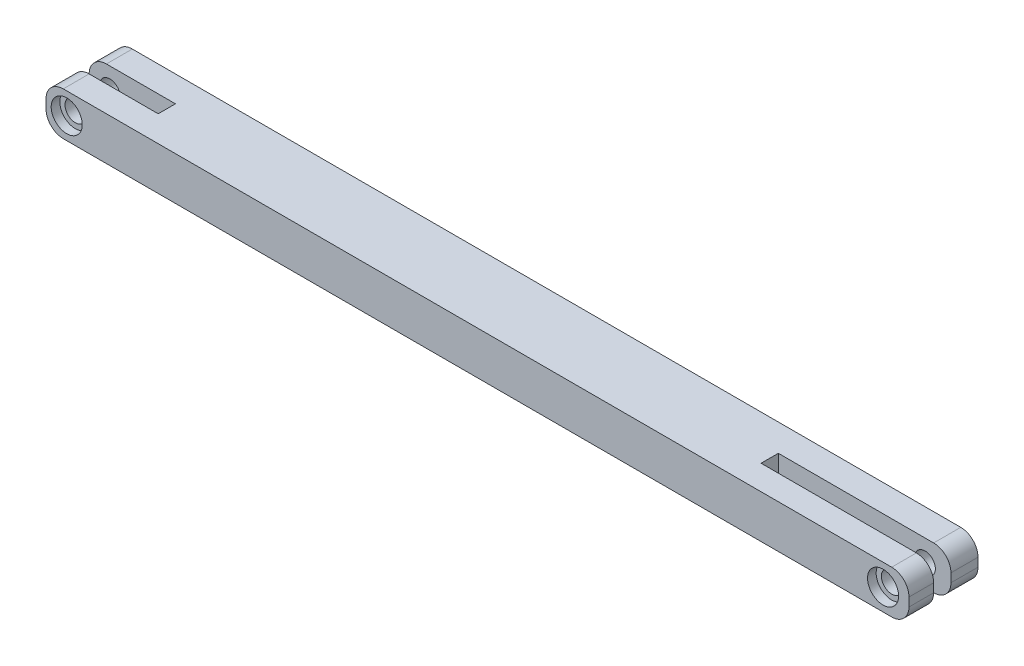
ISO-10303-21;
HEADER;
FILE_DESCRIPTION(('STEP AP214'),'2;1');
FILE_NAME('part.step','',(''),(''),'','','');
FILE_SCHEMA(('AUTOMOTIVE_DESIGN { 1 0 10303 214 1 1 1 1 }'));
ENDSEC;
DATA;
#1=APPLICATION_CONTEXT('core data for automotive mechanical design processes');
#2=APPLICATION_PROTOCOL_DEFINITION('international standard','automotive_design',2000,#1);
#3=PRODUCT_CONTEXT('',#1,'mechanical');
#4=PRODUCT('Part','Part','',(#3));
#5=PRODUCT_RELATED_PRODUCT_CATEGORY('part','',(#4));
#6=PRODUCT_DEFINITION_FORMATION('','',#4);
#7=PRODUCT_DEFINITION_CONTEXT('part definition',#1,'design');
#8=PRODUCT_DEFINITION('design','',#6,#7);
#9=PRODUCT_DEFINITION_SHAPE('','',#8);
#10=(LENGTH_UNIT() NAMED_UNIT(*) SI_UNIT(.MILLI.,.METRE.));
#11=(NAMED_UNIT(*) PLANE_ANGLE_UNIT() SI_UNIT($,.RADIAN.));
#12=(NAMED_UNIT(*) SI_UNIT($,.STERADIAN.) SOLID_ANGLE_UNIT());
#13=UNCERTAINTY_MEASURE_WITH_UNIT(LENGTH_MEASURE(1.E-05),#10,'distance_accuracy_value','');
#14=(GEOMETRIC_REPRESENTATION_CONTEXT(3) GLOBAL_UNCERTAINTY_ASSIGNED_CONTEXT((#13)) GLOBAL_UNIT_ASSIGNED_CONTEXT((#10,
#11,#12)) REPRESENTATION_CONTEXT('',''));
#15=CARTESIAN_POINT('',(0.,0.,0.));
#16=DIRECTION('',(0.,0.,1.));
#17=DIRECTION('',(1.,0.,0.));
#18=AXIS2_PLACEMENT_3D('',#15,#16,#17);
#19=CARTESIAN_POINT('',(485.,12.5,40.));
#20=DIRECTION('',(0.,0.,-1.));
#21=DIRECTION('',(-1.,0.,0.));
#22=AXIS2_PLACEMENT_3D('',#19,#20,#21);
#23=CYLINDRICAL_SURFACE('',#22,5.99999999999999);
#24=CARTESIAN_POINT('',(485.,12.5,15.6934513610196));
#25=DIRECTION('',(0.,0.,-1.));
#26=DIRECTION('',(0.,1.,0.));
#27=AXIS2_PLACEMENT_3D('',#24,#25,#26);
#28=CIRCLE('',#27,5.99999999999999);
#29=CARTESIAN_POINT('',(485.,18.5,15.6934513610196));
#30=VERTEX_POINT('',#29);
#31=EDGE_CURVE('E211',#30,#30,#28,.T.);
#32=ORIENTED_EDGE('',*,*,#31,.F.);
#33=EDGE_LOOP('',(#32));
#34=FACE_BOUND('',#33,.T.);
#35=CARTESIAN_POINT('',(485.,12.5,5.));
#36=DIRECTION('',(0.,0.,-1.));
#37=DIRECTION('',(-1.,0.,0.));
#38=AXIS2_PLACEMENT_3D('',#35,#36,#37);
#39=CIRCLE('',#38,5.99999999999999);
#40=CARTESIAN_POINT('',(479.,12.5,5.));
#41=VERTEX_POINT('',#40);
#42=EDGE_CURVE('E42',#41,#41,#39,.T.);
#43=ORIENTED_EDGE('',*,*,#42,.T.);
#44=EDGE_LOOP('',(#43));
#45=FACE_BOUND('',#44,.T.);
#46=ADVANCED_FACE('F38',(#34,#45),#23,.F.);
#47=CARTESIAN_POINT('',(485.,12.5,25.6934513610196));
#48=DIRECTION('',(0.,0.,1.));
#49=DIRECTION('',(1.,0.,0.));
#50=AXIS2_PLACEMENT_3D('',#47,#48,#49);
#51=CIRCLE('',#50,5.99999999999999);
#52=CARTESIAN_POINT('',(491.,12.5,25.6934513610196));
#53=VERTEX_POINT('',#52);
#54=EDGE_CURVE('E222',#53,#53,#51,.T.);
#55=ORIENTED_EDGE('',*,*,#54,.F.);
#56=EDGE_LOOP('',(#55));
#57=FACE_BOUND('',#56,.T.);
#58=CARTESIAN_POINT('',(485.,12.5,35.));
#59=DIRECTION('',(0.,0.,1.));
#60=DIRECTION('',(1.,0.,0.));
#61=AXIS2_PLACEMENT_3D('',#58,#59,#60);
#62=CIRCLE('',#61,5.99999999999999);
#63=CARTESIAN_POINT('',(491.,12.5,35.));
#64=VERTEX_POINT('',#63);
#65=EDGE_CURVE('E332',#64,#64,#62,.T.);
#66=ORIENTED_EDGE('',*,*,#65,.T.);
#67=EDGE_LOOP('',(#66));
#68=FACE_BOUND('',#67,.T.);
#69=ADVANCED_FACE('F445',(#57,#68),#23,.F.);
#70=CARTESIAN_POINT('',(490.,10.,40.));
#71=DIRECTION('',(0.,0.,-1.));
#72=DIRECTION('',(-1.,0.,0.));
#73=AXIS2_PLACEMENT_3D('',#70,#71,#72);
#74=CYLINDRICAL_SURFACE('',#73,10.);
#75=DIRECTION('',(0.,0.,-1.));
#76=VECTOR('',#75,1.);
#77=CARTESIAN_POINT('',(490.,0.,40.));
#78=LINE('',#77,#76);
#79=CARTESIAN_POINT('',(490.,0.,40.));
#80=VERTEX_POINT('',#79);
#81=CARTESIAN_POINT('',(490.,0.,25.6934513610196));
#82=VERTEX_POINT('',#81);
#83=EDGE_CURVE('E319',#80,#82,#78,.T.);
#84=ORIENTED_EDGE('',*,*,#83,.T.);
#85=CARTESIAN_POINT('',(490.,10.,25.6934513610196));
#86=DIRECTION('',(0.,0.,1.));
#87=DIRECTION('',(1.,0.,0.));
#88=AXIS2_PLACEMENT_3D('',#85,#86,#87);
#89=CIRCLE('',#88,10.);
#90=CARTESIAN_POINT('',(500.,10.0000000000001,25.6934513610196));
#91=VERTEX_POINT('',#90);
#92=EDGE_CURVE('E183',#82,#91,#89,.T.);
#93=ORIENTED_EDGE('',*,*,#92,.T.);
#94=DIRECTION('',(0.,0.,-1.));
#95=VECTOR('',#94,1.);
#96=CARTESIAN_POINT('',(500.,10.0000000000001,40.));
#97=LINE('',#96,#95);
#98=CARTESIAN_POINT('',(500.,10.0000000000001,40.));
#99=VERTEX_POINT('',#98);
#100=EDGE_CURVE('E315',#99,#91,#97,.T.);
#101=ORIENTED_EDGE('',*,*,#100,.F.);
#102=CARTESIAN_POINT('',(490.,10.,40.));
#103=DIRECTION('',(0.,0.,1.));
#104=DIRECTION('',(-1.,0.,0.));
#105=AXIS2_PLACEMENT_3D('',#102,#103,#104);
#106=CIRCLE('',#105,10.);
#107=EDGE_CURVE('E272',#80,#99,#106,.T.);
#108=ORIENTED_EDGE('',*,*,#107,.F.);
#109=EDGE_LOOP('',(#84,#93,#101,#108));
#110=FACE_BOUND('',#109,.T.);
#111=ADVANCED_FACE('F385',(#110),#74,.T.);
#112=CARTESIAN_POINT('',(500.,10.0000000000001,40.));
#113=DIRECTION('',(-1.,0.,0.));
#114=DIRECTION('',(0.,0.,1.));
#115=AXIS2_PLACEMENT_3D('',#112,#113,#114);
#116=PLANE('',#115);
#117=ORIENTED_EDGE('',*,*,#100,.T.);
#118=DIRECTION('',(0.,-1.,0.));
#119=VECTOR('',#118,1.);
#120=CARTESIAN_POINT('',(500.,25.,25.6934513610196));
#121=LINE('',#120,#119);
#122=CARTESIAN_POINT('',(500.,15.,25.6934513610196));
#123=VERTEX_POINT('',#122);
#124=EDGE_CURVE('E205',#123,#91,#121,.T.);
#125=ORIENTED_EDGE('',*,*,#124,.F.);
#126=DIRECTION('',(0.,0.,-1.));
#127=VECTOR('',#126,1.);
#128=CARTESIAN_POINT('',(500.,14.9999999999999,40.));
#129=LINE('',#128,#127);
#130=CARTESIAN_POINT('',(500.,14.9999999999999,40.));
#131=VERTEX_POINT('',#130);
#132=EDGE_CURVE('E311',#131,#123,#129,.T.);
#133=ORIENTED_EDGE('',*,*,#132,.F.);
#134=DIRECTION('',(0.,1.,0.));
#135=VECTOR('',#134,1.);
#136=CARTESIAN_POINT('',(500.,10.0000000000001,40.));
#137=LINE('',#136,#135);
#138=EDGE_CURVE('E274',#99,#131,#137,.T.);
#139=ORIENTED_EDGE('',*,*,#138,.F.);
#140=EDGE_LOOP('',(#117,#125,#133,#139));
#141=FACE_BOUND('',#140,.T.);
#142=ADVANCED_FACE('F390',(#141),#116,.F.);
#143=CARTESIAN_POINT('',(490.,15.,40.));
#144=DIRECTION('',(0.,0.,-1.));
#145=DIRECTION('',(-1.,0.,0.));
#146=AXIS2_PLACEMENT_3D('',#143,#144,#145);
#147=CYLINDRICAL_SURFACE('',#146,10.);
#148=ORIENTED_EDGE('',*,*,#132,.T.);
#149=CARTESIAN_POINT('',(490.,15.,25.6934513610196));
#150=DIRECTION('',(0.,0.,1.));
#151=DIRECTION('',(1.,0.,0.));
#152=AXIS2_PLACEMENT_3D('',#149,#150,#151);
#153=CIRCLE('',#152,10.);
#154=CARTESIAN_POINT('',(490.,25.,25.6934513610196));
#155=VERTEX_POINT('',#154);
#156=EDGE_CURVE('E223',#123,#155,#153,.T.);
#157=ORIENTED_EDGE('',*,*,#156,.T.);
#158=DIRECTION('',(0.,0.,-1.));
#159=VECTOR('',#158,1.);
#160=CARTESIAN_POINT('',(490.,25.,40.));
#161=LINE('',#160,#159);
#162=CARTESIAN_POINT('',(490.,25.,40.));
#163=VERTEX_POINT('',#162);
#164=EDGE_CURVE('E307',#163,#155,#161,.T.);
#165=ORIENTED_EDGE('',*,*,#164,.F.);
#166=CARTESIAN_POINT('',(490.,15.,40.));
#167=DIRECTION('',(0.,0.,1.));
#168=DIRECTION('',(1.,0.,0.));
#169=AXIS2_PLACEMENT_3D('',#166,#167,#168);
#170=CIRCLE('',#169,10.);
#171=EDGE_CURVE('E276',#131,#163,#170,.T.);
#172=ORIENTED_EDGE('',*,*,#171,.F.);
#173=EDGE_LOOP('',(#148,#157,#165,#172));
#174=FACE_BOUND('',#173,.T.);
#175=ADVANCED_FACE('F394',(#174),#147,.T.);
#176=CARTESIAN_POINT('',(10.,15.,40.));
#177=DIRECTION('',(0.,0.,-1.));
#178=DIRECTION('',(-1.,0.,0.));
#179=AXIS2_PLACEMENT_3D('',#176,#177,#178);
#180=CYLINDRICAL_SURFACE('',#179,10.);
#181=DIRECTION('',(0.,0.,-1.));
#182=VECTOR('',#181,1.);
#183=CARTESIAN_POINT('',(0.,14.9999999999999,40.));
#184=LINE('',#183,#182);
#185=CARTESIAN_POINT('',(0.,14.9999999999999,15.));
#186=VERTEX_POINT('',#185);
#187=CARTESIAN_POINT('',(0.,14.9999999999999,0.));
#188=VERTEX_POINT('',#187);
#189=EDGE_CURVE('E47',#186,#188,#184,.T.);
#190=ORIENTED_EDGE('',*,*,#189,.F.);
#191=CARTESIAN_POINT('',(10.,15.,15.));
#192=DIRECTION('',(0.,0.,-1.));
#193=DIRECTION('',(0.,1.,0.));
#194=AXIS2_PLACEMENT_3D('',#191,#192,#193);
#195=CIRCLE('',#194,10.);
#196=CARTESIAN_POINT('',(10.,25.,15.));
#197=VERTEX_POINT('',#196);
#198=EDGE_CURVE('E258',#186,#197,#195,.T.);
#199=ORIENTED_EDGE('',*,*,#198,.T.);
#200=DIRECTION('',(0.,0.,-1.));
#201=VECTOR('',#200,1.);
#202=CARTESIAN_POINT('',(10.,25.,40.));
#203=LINE('',#202,#201);
#204=CARTESIAN_POINT('',(10.,25.,0.));
#205=VERTEX_POINT('',#204);
#206=EDGE_CURVE('E280',#197,#205,#203,.T.);
#207=ORIENTED_EDGE('',*,*,#206,.T.);
#208=CARTESIAN_POINT('',(10.,15.,0.));
#209=DIRECTION('',(0.,0.,1.));
#210=DIRECTION('',(-1.,0.,0.));
#211=AXIS2_PLACEMENT_3D('',#208,#209,#210);
#212=CIRCLE('',#211,10.);
#213=EDGE_CURVE('E261',#205,#188,#212,.T.);
#214=ORIENTED_EDGE('',*,*,#213,.T.);
#215=EDGE_LOOP('',(#190,#199,#207,#214));
#216=FACE_BOUND('',#215,.T.);
#217=ADVANCED_FACE('F436',(#216),#180,.T.);
#218=CARTESIAN_POINT('',(0.,10.0000000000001,40.));
#219=DIRECTION('',(1.,0.,0.));
#220=DIRECTION('',(0.,0.,-1.));
#221=AXIS2_PLACEMENT_3D('',#218,#219,#220);
#222=PLANE('',#221);
#223=DIRECTION('',(0.,0.,-1.));
#224=VECTOR('',#223,1.);
#225=CARTESIAN_POINT('',(0.,10.0000000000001,40.));
#226=LINE('',#225,#224);
#227=CARTESIAN_POINT('',(0.,10.,15.));
#228=VERTEX_POINT('',#227);
#229=CARTESIAN_POINT('',(0.,10.0000000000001,0.));
#230=VERTEX_POINT('',#229);
#231=EDGE_CURVE('E325',#228,#230,#226,.T.);
#232=ORIENTED_EDGE('',*,*,#231,.F.);
#233=DIRECTION('',(0.,-1.,0.));
#234=VECTOR('',#233,1.);
#235=CARTESIAN_POINT('',(0.,25.,15.));
#236=LINE('',#235,#234);
#237=EDGE_CURVE('E227',#186,#228,#236,.T.);
#238=ORIENTED_EDGE('',*,*,#237,.F.);
#239=ORIENTED_EDGE('',*,*,#189,.T.);
#240=DIRECTION('',(0.,-1.,0.));
#241=VECTOR('',#240,1.);
#242=CARTESIAN_POINT('',(0.,10.0000000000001,0.));
#243=LINE('',#242,#241);
#244=EDGE_CURVE('E283',#188,#230,#243,.T.);
#245=ORIENTED_EDGE('',*,*,#244,.T.);
#246=EDGE_LOOP('',(#232,#238,#239,#245));
#247=FACE_BOUND('',#246,.T.);
#248=ADVANCED_FACE('F411',(#247),#222,.F.);
#249=CARTESIAN_POINT('',(10.,10.,40.));
#250=DIRECTION('',(0.,0.,-1.));
#251=DIRECTION('',(-1.,0.,0.));
#252=AXIS2_PLACEMENT_3D('',#249,#250,#251);
#253=CYLINDRICAL_SURFACE('',#252,10.);
#254=DIRECTION('',(0.,0.,-1.));
#255=VECTOR('',#254,1.);
#256=CARTESIAN_POINT('',(10.0000000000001,0.,40.));
#257=LINE('',#256,#255);
#258=CARTESIAN_POINT('',(10.0000000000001,0.,15.));
#259=VERTEX_POINT('',#258);
#260=CARTESIAN_POINT('',(10.0000000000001,0.,0.));
#261=VERTEX_POINT('',#260);
#262=EDGE_CURVE('E321',#259,#261,#257,.T.);
#263=ORIENTED_EDGE('',*,*,#262,.F.);
#264=CARTESIAN_POINT('',(10.,10.,15.));
#265=DIRECTION('',(0.,0.,-1.));
#266=DIRECTION('',(0.,1.,0.));
#267=AXIS2_PLACEMENT_3D('',#264,#265,#266);
#268=CIRCLE('',#267,10.);
#269=EDGE_CURVE('E255',#259,#228,#268,.T.);
#270=ORIENTED_EDGE('',*,*,#269,.T.);
#271=ORIENTED_EDGE('',*,*,#231,.T.);
#272=CARTESIAN_POINT('',(10.,10.,0.));
#273=DIRECTION('',(0.,0.,1.));
#274=DIRECTION('',(-1.,0.,0.));
#275=AXIS2_PLACEMENT_3D('',#272,#273,#274);
#276=CIRCLE('',#275,10.);
#277=EDGE_CURVE('E286',#230,#261,#276,.T.);
#278=ORIENTED_EDGE('',*,*,#277,.T.);
#279=EDGE_LOOP('',(#263,#270,#271,#278));
#280=FACE_BOUND('',#279,.T.);
#281=ADVANCED_FACE('F365',(#280),#253,.T.);
#282=CARTESIAN_POINT('',(10.,15.,40.));
#283=DIRECTION('',(0.,0.,-1.));
#284=DIRECTION('',(-1.,0.,0.));
#285=AXIS2_PLACEMENT_3D('',#282,#283,#284);
#286=PLANE('',#285);
#287=CARTESIAN_POINT('',(485.,12.5,40.));
#288=DIRECTION('',(0.,0.,1.));
#289=DIRECTION('',(1.,0.,0.));
#290=AXIS2_PLACEMENT_3D('',#287,#288,#289);
#291=CIRCLE('',#290,8.99999999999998);
#292=CARTESIAN_POINT('',(494.,12.5,40.));
#293=VERTEX_POINT('',#292);
#294=EDGE_CURVE('E340',#293,#293,#291,.T.);
#295=ORIENTED_EDGE('',*,*,#294,.F.);
#296=EDGE_LOOP('',(#295));
#297=FACE_BOUND('',#296,.T.);
#298=CARTESIAN_POINT('',(12.,12.5,40.));
#299=DIRECTION('',(0.,0.,1.));
#300=DIRECTION('',(1.,0.,0.));
#301=AXIS2_PLACEMENT_3D('',#298,#299,#300);
#302=CIRCLE('',#301,9.00000000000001);
#303=CARTESIAN_POINT('',(21.,12.5,40.));
#304=VERTEX_POINT('',#303);
#305=EDGE_CURVE('E334',#304,#304,#302,.T.);
#306=ORIENTED_EDGE('',*,*,#305,.F.);
#307=EDGE_LOOP('',(#306));
#308=FACE_BOUND('',#307,.T.);
#309=CARTESIAN_POINT('',(10.,15.,40.));
#310=DIRECTION('',(0.,0.,1.));
#311=DIRECTION('',(-1.,0.,0.));
#312=AXIS2_PLACEMENT_3D('',#309,#310,#311);
#313=CIRCLE('',#312,10.);
#314=CARTESIAN_POINT('',(10.,25.,40.));
#315=VERTEX_POINT('',#314);
#316=CARTESIAN_POINT('',(0.,14.9999999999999,40.));
#317=VERTEX_POINT('',#316);
#318=EDGE_CURVE('E262',#315,#317,#313,.T.);
#319=ORIENTED_EDGE('',*,*,#318,.T.);
#320=DIRECTION('',(0.,-1.,0.));
#321=VECTOR('',#320,1.);
#322=CARTESIAN_POINT('',(0.,10.0000000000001,40.));
#323=LINE('',#322,#321);
#324=CARTESIAN_POINT('',(0.,10.0000000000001,40.));
#325=VERTEX_POINT('',#324);
#326=EDGE_CURVE('E265',#317,#325,#323,.T.);
#327=ORIENTED_EDGE('',*,*,#326,.T.);
#328=CARTESIAN_POINT('',(10.,10.,40.));
#329=DIRECTION('',(0.,0.,1.));
#330=DIRECTION('',(-1.,0.,0.));
#331=AXIS2_PLACEMENT_3D('',#328,#329,#330);
#332=CIRCLE('',#331,10.);
#333=CARTESIAN_POINT('',(10.0000000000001,0.,40.));
#334=VERTEX_POINT('',#333);
#335=EDGE_CURVE('E268',#325,#334,#332,.T.);
#336=ORIENTED_EDGE('',*,*,#335,.T.);
#337=DIRECTION('',(1.,0.,0.));
#338=VECTOR('',#337,1.);
#339=CARTESIAN_POINT('',(10.0000000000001,0.,40.));
#340=LINE('',#339,#338);
#341=EDGE_CURVE('E270',#334,#80,#340,.T.);
#342=ORIENTED_EDGE('',*,*,#341,.T.);
#343=ORIENTED_EDGE('',*,*,#107,.T.);
#344=ORIENTED_EDGE('',*,*,#138,.T.);
#345=ORIENTED_EDGE('',*,*,#171,.T.);
#346=DIRECTION('',(-1.,0.,0.));
#347=VECTOR('',#346,1.);
#348=CARTESIAN_POINT('',(10.,25.,40.));
#349=LINE('',#348,#347);
#350=EDGE_CURVE('E278',#163,#315,#349,.T.);
#351=ORIENTED_EDGE('',*,*,#350,.T.);
#352=EDGE_LOOP('',(#319,#327,#336,#342,#343,#344,#345,#351));
#353=FACE_BOUND('',#352,.T.);
#354=ADVANCED_FACE('F361',(#297,#308,#353),#286,.F.);
#355=CARTESIAN_POINT('',(10.,15.,0.));
#356=DIRECTION('',(0.,0.,-1.));
#357=DIRECTION('',(-1.,0.,0.));
#358=AXIS2_PLACEMENT_3D('',#355,#356,#357);
#359=PLANE('',#358);
#360=CARTESIAN_POINT('',(12.,12.5,0.));
#361=DIRECTION('',(0.,0.,-1.));
#362=DIRECTION('',(-1.,0.,0.));
#363=AXIS2_PLACEMENT_3D('',#360,#361,#362);
#364=CIRCLE('',#363,9.);
#365=CARTESIAN_POINT('',(3.,12.5,0.));
#366=VERTEX_POINT('',#365);
#367=EDGE_CURVE('E731',#366,#366,#364,.T.);
#368=ORIENTED_EDGE('',*,*,#367,.F.);
#369=EDGE_LOOP('',(#368));
#370=FACE_BOUND('',#369,.T.);
#371=CARTESIAN_POINT('',(485.,12.5,0.));
#372=DIRECTION('',(0.,0.,-1.));
#373=DIRECTION('',(-1.,0.,0.));
#374=AXIS2_PLACEMENT_3D('',#371,#372,#373);
#375=CIRCLE('',#374,8.99999999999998);
#376=CARTESIAN_POINT('',(476.,12.5,0.));
#377=VERTEX_POINT('',#376);
#378=EDGE_CURVE('E347',#377,#377,#375,.T.);
#379=ORIENTED_EDGE('',*,*,#378,.F.);
#380=EDGE_LOOP('',(#379));
#381=FACE_BOUND('',#380,.T.);
#382=ORIENTED_EDGE('',*,*,#213,.F.);
#383=DIRECTION('',(-1.,0.,0.));
#384=VECTOR('',#383,1.);
#385=CARTESIAN_POINT('',(10.,25.,0.));
#386=LINE('',#385,#384);
#387=CARTESIAN_POINT('',(490.,25.,0.));
#388=VERTEX_POINT('',#387);
#389=EDGE_CURVE('E266',#388,#205,#386,.T.);
#390=ORIENTED_EDGE('',*,*,#389,.F.);
#391=CARTESIAN_POINT('',(490.,15.,0.));
#392=DIRECTION('',(0.,0.,1.));
#393=DIRECTION('',(1.,0.,0.));
#394=AXIS2_PLACEMENT_3D('',#391,#392,#393);
#395=CIRCLE('',#394,10.);
#396=CARTESIAN_POINT('',(500.,14.9999999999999,0.));
#397=VERTEX_POINT('',#396);
#398=EDGE_CURVE('E298',#397,#388,#395,.T.);
#399=ORIENTED_EDGE('',*,*,#398,.F.);
#400=DIRECTION('',(0.,1.,0.));
#401=VECTOR('',#400,1.);
#402=CARTESIAN_POINT('',(500.,10.0000000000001,0.));
#403=LINE('',#402,#401);
#404=CARTESIAN_POINT('',(500.,10.0000000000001,0.));
#405=VERTEX_POINT('',#404);
#406=EDGE_CURVE('E295',#405,#397,#403,.T.);
#407=ORIENTED_EDGE('',*,*,#406,.F.);
#408=CARTESIAN_POINT('',(490.,10.,0.));
#409=DIRECTION('',(0.,0.,1.));
#410=DIRECTION('',(-1.,0.,0.));
#411=AXIS2_PLACEMENT_3D('',#408,#409,#410);
#412=CIRCLE('',#411,10.);
#413=CARTESIAN_POINT('',(490.,0.,0.));
#414=VERTEX_POINT('',#413);
#415=EDGE_CURVE('E292',#414,#405,#412,.T.);
#416=ORIENTED_EDGE('',*,*,#415,.F.);
#417=DIRECTION('',(1.,0.,0.));
#418=VECTOR('',#417,1.);
#419=CARTESIAN_POINT('',(10.0000000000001,0.,0.));
#420=LINE('',#419,#418);
#421=EDGE_CURVE('E289',#261,#414,#420,.T.);
#422=ORIENTED_EDGE('',*,*,#421,.F.);
#423=ORIENTED_EDGE('',*,*,#277,.F.);
#424=ORIENTED_EDGE('',*,*,#244,.F.);
#425=EDGE_LOOP('',(#382,#390,#399,#407,#416,#422,#423,#424));
#426=FACE_BOUND('',#425,.T.);
#427=ADVANCED_FACE('F364',(#370,#381,#426),#359,.T.);
#428=CARTESIAN_POINT('',(10.,25.,25.));
#429=VERTEX_POINT('',#428);
#430=EDGE_CURVE('E303',#315,#429,#203,.T.);
#431=ORIENTED_EDGE('',*,*,#430,.T.);
#432=CARTESIAN_POINT('',(10.,15.,25.));
#433=DIRECTION('',(0.,0.,1.));
#434=DIRECTION('',(0.,-1.,0.));
#435=AXIS2_PLACEMENT_3D('',#432,#433,#434);
#436=CIRCLE('',#435,10.);
#437=CARTESIAN_POINT('',(0.,14.9999999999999,25.));
#438=VERTEX_POINT('',#437);
#439=EDGE_CURVE('E252',#429,#438,#436,.T.);
#440=ORIENTED_EDGE('',*,*,#439,.T.);
#441=EDGE_CURVE('E12',#317,#438,#184,.T.);
#442=ORIENTED_EDGE('',*,*,#441,.F.);
#443=ORIENTED_EDGE('',*,*,#318,.F.);
#444=EDGE_LOOP('',(#431,#440,#442,#443));
#445=FACE_BOUND('',#444,.T.);
#446=ADVANCED_FACE('F40',(#445),#180,.T.);
#447=ORIENTED_EDGE('',*,*,#441,.T.);
#448=DIRECTION('',(0.,1.,0.));
#449=VECTOR('',#448,1.);
#450=CARTESIAN_POINT('',(0.,25.,25.));
#451=LINE('',#450,#449);
#452=CARTESIAN_POINT('',(0.,10.,25.));
#453=VERTEX_POINT('',#452);
#454=EDGE_CURVE('E232',#453,#438,#451,.T.);
#455=ORIENTED_EDGE('',*,*,#454,.F.);
#456=EDGE_CURVE('E326',#325,#453,#226,.T.);
#457=ORIENTED_EDGE('',*,*,#456,.F.);
#458=ORIENTED_EDGE('',*,*,#326,.F.);
#459=EDGE_LOOP('',(#447,#455,#457,#458));
#460=FACE_BOUND('',#459,.T.);
#461=ADVANCED_FACE('F376',(#460),#222,.F.);
#462=ORIENTED_EDGE('',*,*,#456,.T.);
#463=CARTESIAN_POINT('',(10.,10.,25.));
#464=DIRECTION('',(0.,0.,1.));
#465=DIRECTION('',(0.,-1.,0.));
#466=AXIS2_PLACEMENT_3D('',#463,#464,#465);
#467=CIRCLE('',#466,10.);
#468=CARTESIAN_POINT('',(10.0000000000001,0.,25.));
#469=VERTEX_POINT('',#468);
#470=EDGE_CURVE('E242',#453,#469,#467,.T.);
#471=ORIENTED_EDGE('',*,*,#470,.T.);
#472=EDGE_CURVE('E322',#334,#469,#257,.T.);
#473=ORIENTED_EDGE('',*,*,#472,.F.);
#474=ORIENTED_EDGE('',*,*,#335,.F.);
#475=EDGE_LOOP('',(#462,#471,#473,#474));
#476=FACE_BOUND('',#475,.T.);
#477=ADVANCED_FACE('F380',(#476),#253,.T.);
#478=CARTESIAN_POINT('',(10.0000000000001,0.,40.));
#479=DIRECTION('',(0.,1.,0.));
#480=DIRECTION('',(0.,0.,1.));
#481=AXIS2_PLACEMENT_3D('',#478,#479,#480);
#482=PLANE('',#481);
#483=DIRECTION('',(0.,0.,-1.));
#484=VECTOR('',#483,1.);
#485=CARTESIAN_POINT('',(400.,0.,25.6934513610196));
#486=LINE('',#485,#484);
#487=CARTESIAN_POINT('',(400.,0.,25.6934513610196));
#488=VERTEX_POINT('',#487);
#489=CARTESIAN_POINT('',(400.,0.,15.6934513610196));
#490=VERTEX_POINT('',#489);
#491=EDGE_CURVE('E192',#488,#490,#486,.T.);
#492=ORIENTED_EDGE('',*,*,#491,.F.);
#493=DIRECTION('',(1.,0.,0.));
#494=VECTOR('',#493,1.);
#495=CARTESIAN_POINT('',(400.,0.,25.6934513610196));
#496=LINE('',#495,#494);
#497=EDGE_CURVE('E178',#488,#82,#496,.T.);
#498=ORIENTED_EDGE('',*,*,#497,.T.);
#499=ORIENTED_EDGE('',*,*,#83,.F.);
#500=ORIENTED_EDGE('',*,*,#341,.F.);
#501=ORIENTED_EDGE('',*,*,#472,.T.);
#502=DIRECTION('',(-1.,0.,0.));
#503=VECTOR('',#502,1.);
#504=CARTESIAN_POINT('',(50.,0.,25.));
#505=LINE('',#504,#503);
#506=CARTESIAN_POINT('',(50.,0.,25.));
#507=VERTEX_POINT('',#506);
#508=EDGE_CURVE('E246',#507,#469,#505,.T.);
#509=ORIENTED_EDGE('',*,*,#508,.F.);
#510=DIRECTION('',(0.,0.,1.));
#511=VECTOR('',#510,1.);
#512=CARTESIAN_POINT('',(50.,0.,15.));
#513=LINE('',#512,#511);
#514=CARTESIAN_POINT('',(50.,0.,15.));
#515=VERTEX_POINT('',#514);
#516=EDGE_CURVE('E231',#515,#507,#513,.T.);
#517=ORIENTED_EDGE('',*,*,#516,.F.);
#518=DIRECTION('',(-1.,0.,0.));
#519=VECTOR('',#518,1.);
#520=CARTESIAN_POINT('',(50.,0.,15.));
#521=LINE('',#520,#519);
#522=EDGE_CURVE('E237',#515,#259,#521,.T.);
#523=ORIENTED_EDGE('',*,*,#522,.T.);
#524=ORIENTED_EDGE('',*,*,#262,.T.);
#525=ORIENTED_EDGE('',*,*,#421,.T.);
#526=CARTESIAN_POINT('',(490.,0.,15.6934513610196));
#527=VERTEX_POINT('',#526);
#528=EDGE_CURVE('E318',#527,#414,#78,.T.);
#529=ORIENTED_EDGE('',*,*,#528,.F.);
#530=DIRECTION('',(1.,0.,0.));
#531=VECTOR('',#530,1.);
#532=CARTESIAN_POINT('',(400.,0.,15.6934513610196));
#533=LINE('',#532,#531);
#534=EDGE_CURVE('E188',#490,#527,#533,.T.);
#535=ORIENTED_EDGE('',*,*,#534,.F.);
#536=EDGE_LOOP('',(#492,#498,#499,#500,#501,#509,#517,#523,#524,#525,#529,#535));
#537=FACE_BOUND('',#536,.T.);
#538=ADVANCED_FACE('F198',(#537),#482,.F.);
#539=CARTESIAN_POINT('',(500.,10.0000000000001,15.6934513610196));
#540=VERTEX_POINT('',#539);
#541=EDGE_CURVE('E314',#540,#405,#97,.T.);
#542=ORIENTED_EDGE('',*,*,#541,.F.);
#543=CARTESIAN_POINT('',(490.,10.,15.6934513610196));
#544=DIRECTION('',(0.,0.,-1.));
#545=DIRECTION('',(0.,1.,0.));
#546=AXIS2_PLACEMENT_3D('',#543,#544,#545);
#547=CIRCLE('',#546,10.);
#548=EDGE_CURVE('E219',#540,#527,#547,.T.);
#549=ORIENTED_EDGE('',*,*,#548,.T.);
#550=ORIENTED_EDGE('',*,*,#528,.T.);
#551=ORIENTED_EDGE('',*,*,#415,.T.);
#552=EDGE_LOOP('',(#542,#549,#550,#551));
#553=FACE_BOUND('',#552,.T.);
#554=ADVANCED_FACE('F422',(#553),#74,.T.);
#555=CARTESIAN_POINT('',(500.,15.,15.6934513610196));
#556=VERTEX_POINT('',#555);
#557=EDGE_CURVE('E310',#556,#397,#129,.T.);
#558=ORIENTED_EDGE('',*,*,#557,.F.);
#559=DIRECTION('',(0.,1.,0.));
#560=VECTOR('',#559,1.);
#561=CARTESIAN_POINT('',(500.,25.,15.6934513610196));
#562=LINE('',#561,#560);
#563=EDGE_CURVE('E196',#540,#556,#562,.T.);
#564=ORIENTED_EDGE('',*,*,#563,.F.);
#565=ORIENTED_EDGE('',*,*,#541,.T.);
#566=ORIENTED_EDGE('',*,*,#406,.T.);
#567=EDGE_LOOP('',(#558,#564,#565,#566));
#568=FACE_BOUND('',#567,.T.);
#569=ADVANCED_FACE('F428',(#568),#116,.F.);
#570=CARTESIAN_POINT('',(490.,25.,15.6934513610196));
#571=VERTEX_POINT('',#570);
#572=EDGE_CURVE('E306',#571,#388,#161,.T.);
#573=ORIENTED_EDGE('',*,*,#572,.F.);
#574=CARTESIAN_POINT('',(490.,15.,15.6934513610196));
#575=DIRECTION('',(0.,0.,-1.));
#576=DIRECTION('',(0.,1.,0.));
#577=AXIS2_PLACEMENT_3D('',#574,#575,#576);
#578=CIRCLE('',#577,10.);
#579=EDGE_CURVE('E216',#571,#556,#578,.T.);
#580=ORIENTED_EDGE('',*,*,#579,.T.);
#581=ORIENTED_EDGE('',*,*,#557,.T.);
#582=ORIENTED_EDGE('',*,*,#398,.T.);
#583=EDGE_LOOP('',(#573,#580,#581,#582));
#584=FACE_BOUND('',#583,.T.);
#585=ADVANCED_FACE('F432',(#584),#147,.T.);
#586=CARTESIAN_POINT('',(10.,25.,40.));
#587=DIRECTION('',(0.,-1.,0.));
#588=DIRECTION('',(1.,0.,0.));
#589=AXIS2_PLACEMENT_3D('',#586,#587,#588);
#590=PLANE('',#589);
#591=ORIENTED_EDGE('',*,*,#164,.T.);
#592=DIRECTION('',(1.,0.,0.));
#593=VECTOR('',#592,1.);
#594=CARTESIAN_POINT('',(400.,25.,25.6934513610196));
#595=LINE('',#594,#593);
#596=CARTESIAN_POINT('',(400.,25.,25.6934513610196));
#597=VERTEX_POINT('',#596);
#598=EDGE_CURVE('E209',#597,#155,#595,.T.);
#599=ORIENTED_EDGE('',*,*,#598,.F.);
#600=DIRECTION('',(0.,0.,1.));
#601=VECTOR('',#600,1.);
#602=CARTESIAN_POINT('',(400.,25.,25.6934513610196));
#603=LINE('',#602,#601);
#604=CARTESIAN_POINT('',(400.,25.,15.6934513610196));
#605=VERTEX_POINT('',#604);
#606=EDGE_CURVE('E189',#605,#597,#603,.T.);
#607=ORIENTED_EDGE('',*,*,#606,.F.);
#608=DIRECTION('',(1.,0.,0.));
#609=VECTOR('',#608,1.);
#610=CARTESIAN_POINT('',(400.,25.,15.6934513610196));
#611=LINE('',#610,#609);
#612=EDGE_CURVE('E212',#605,#571,#611,.T.);
#613=ORIENTED_EDGE('',*,*,#612,.T.);
#614=ORIENTED_EDGE('',*,*,#572,.T.);
#615=ORIENTED_EDGE('',*,*,#389,.T.);
#616=ORIENTED_EDGE('',*,*,#206,.F.);
#617=DIRECTION('',(-1.,0.,0.));
#618=VECTOR('',#617,1.);
#619=CARTESIAN_POINT('',(50.,25.,15.));
#620=LINE('',#619,#618);
#621=CARTESIAN_POINT('',(50.,25.,15.));
#622=VERTEX_POINT('',#621);
#623=EDGE_CURVE('E240',#622,#197,#620,.T.);
#624=ORIENTED_EDGE('',*,*,#623,.F.);
#625=DIRECTION('',(0.,0.,-1.));
#626=VECTOR('',#625,1.);
#627=CARTESIAN_POINT('',(50.,25.,15.));
#628=LINE('',#627,#626);
#629=CARTESIAN_POINT('',(50.,25.,25.));
#630=VERTEX_POINT('',#629);
#631=EDGE_CURVE('E235',#630,#622,#628,.T.);
#632=ORIENTED_EDGE('',*,*,#631,.F.);
#633=DIRECTION('',(-1.,0.,0.));
#634=VECTOR('',#633,1.);
#635=CARTESIAN_POINT('',(50.,25.,25.));
#636=LINE('',#635,#634);
#637=EDGE_CURVE('E243',#630,#429,#636,.T.);
#638=ORIENTED_EDGE('',*,*,#637,.T.);
#639=ORIENTED_EDGE('',*,*,#430,.F.);
#640=ORIENTED_EDGE('',*,*,#350,.F.);
#641=EDGE_LOOP('',(#591,#599,#607,#613,#614,#615,#616,#624,#632,#638,#639,#640));
#642=FACE_BOUND('',#641,.T.);
#643=ADVANCED_FACE('F396',(#642),#590,.F.);
#644=CARTESIAN_POINT('',(50.,25.,15.));
#645=DIRECTION('',(0.,0.,-1.));
#646=DIRECTION('',(0.,1.,0.));
#647=AXIS2_PLACEMENT_3D('',#644,#645,#646);
#648=PLANE('',#647);
#649=CARTESIAN_POINT('',(12.,12.5,15.));
#650=DIRECTION('',(0.,0.,-1.));
#651=DIRECTION('',(-1.,0.,0.));
#652=AXIS2_PLACEMENT_3D('',#649,#650,#651);
#653=CIRCLE('',#652,6.);
#654=CARTESIAN_POINT('',(6.,12.5,15.));
#655=VERTEX_POINT('',#654);
#656=EDGE_CURVE('E726',#655,#655,#653,.T.);
#657=ORIENTED_EDGE('',*,*,#656,.T.);
#658=EDGE_LOOP('',(#657));
#659=FACE_BOUND('',#658,.T.);
#660=ORIENTED_EDGE('',*,*,#237,.T.);
#661=ORIENTED_EDGE('',*,*,#269,.F.);
#662=ORIENTED_EDGE('',*,*,#522,.F.);
#663=DIRECTION('',(0.,-1.,0.));
#664=VECTOR('',#663,1.);
#665=CARTESIAN_POINT('',(50.,25.,15.));
#666=LINE('',#665,#664);
#667=EDGE_CURVE('E228',#622,#515,#666,.T.);
#668=ORIENTED_EDGE('',*,*,#667,.F.);
#669=ORIENTED_EDGE('',*,*,#623,.T.);
#670=ORIENTED_EDGE('',*,*,#198,.F.);
#671=EDGE_LOOP('',(#660,#661,#662,#668,#669,#670));
#672=FACE_BOUND('',#671,.T.);
#673=ADVANCED_FACE('F406',(#659,#672),#648,.F.);
#674=CARTESIAN_POINT('',(50.,25.,25.));
#675=DIRECTION('',(0.,0.,1.));
#676=DIRECTION('',(0.,-1.,0.));
#677=AXIS2_PLACEMENT_3D('',#674,#675,#676);
#678=PLANE('',#677);
#679=CARTESIAN_POINT('',(12.,12.5,25.));
#680=DIRECTION('',(0.,0.,1.));
#681=DIRECTION('',(1.,0.,0.));
#682=AXIS2_PLACEMENT_3D('',#679,#680,#681);
#683=CIRCLE('',#682,6.);
#684=CARTESIAN_POINT('',(18.,12.5,25.));
#685=VERTEX_POINT('',#684);
#686=EDGE_CURVE('E740',#685,#685,#683,.T.);
#687=ORIENTED_EDGE('',*,*,#686,.T.);
#688=EDGE_LOOP('',(#687));
#689=FACE_BOUND('',#688,.T.);
#690=ORIENTED_EDGE('',*,*,#637,.F.);
#691=DIRECTION('',(0.,1.,0.));
#692=VECTOR('',#691,1.);
#693=CARTESIAN_POINT('',(50.,25.,25.));
#694=LINE('',#693,#692);
#695=EDGE_CURVE('E63',#507,#630,#694,.T.);
#696=ORIENTED_EDGE('',*,*,#695,.F.);
#697=ORIENTED_EDGE('',*,*,#508,.T.);
#698=ORIENTED_EDGE('',*,*,#470,.F.);
#699=ORIENTED_EDGE('',*,*,#454,.T.);
#700=ORIENTED_EDGE('',*,*,#439,.F.);
#701=EDGE_LOOP('',(#690,#696,#697,#698,#699,#700));
#702=FACE_BOUND('',#701,.T.);
#703=ADVANCED_FACE('F400',(#689,#702),#678,.F.);
#704=CARTESIAN_POINT('',(50.,0.,0.));
#705=DIRECTION('',(-1.,0.,0.));
#706=DIRECTION('',(0.,0.,1.));
#707=AXIS2_PLACEMENT_3D('',#704,#705,#706);
#708=PLANE('',#707);
#709=ORIENTED_EDGE('',*,*,#667,.T.);
#710=ORIENTED_EDGE('',*,*,#516,.T.);
#711=ORIENTED_EDGE('',*,*,#695,.T.);
#712=ORIENTED_EDGE('',*,*,#631,.T.);
#713=EDGE_LOOP('',(#709,#710,#711,#712));
#714=FACE_BOUND('',#713,.T.);
#715=ADVANCED_FACE('F404',(#714),#708,.T.);
#716=CARTESIAN_POINT('',(400.,25.,25.6934513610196));
#717=DIRECTION('',(0.,0.,1.));
#718=DIRECTION('',(1.,0.,0.));
#719=AXIS2_PLACEMENT_3D('',#716,#717,#718);
#720=PLANE('',#719);
#721=ORIENTED_EDGE('',*,*,#54,.T.);
#722=EDGE_LOOP('',(#721));
#723=FACE_BOUND('',#722,.T.);
#724=ORIENTED_EDGE('',*,*,#497,.F.);
#725=DIRECTION('',(0.,-1.,0.));
#726=VECTOR('',#725,1.);
#727=CARTESIAN_POINT('',(400.,25.,25.6934513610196));
#728=LINE('',#727,#726);
#729=EDGE_CURVE('E181',#597,#488,#728,.T.);
#730=ORIENTED_EDGE('',*,*,#729,.F.);
#731=ORIENTED_EDGE('',*,*,#598,.T.);
#732=ORIENTED_EDGE('',*,*,#156,.F.);
#733=ORIENTED_EDGE('',*,*,#124,.T.);
#734=ORIENTED_EDGE('',*,*,#92,.F.);
#735=EDGE_LOOP('',(#724,#730,#731,#732,#733,#734));
#736=FACE_BOUND('',#735,.T.);
#737=ADVANCED_FACE('F180',(#723,#736),#720,.F.);
#738=CARTESIAN_POINT('',(400.,25.,15.6934513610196));
#739=DIRECTION('',(0.,0.,-1.));
#740=DIRECTION('',(0.,1.,0.));
#741=AXIS2_PLACEMENT_3D('',#738,#739,#740);
#742=PLANE('',#741);
#743=ORIENTED_EDGE('',*,*,#31,.T.);
#744=EDGE_LOOP('',(#743));
#745=FACE_BOUND('',#744,.T.);
#746=ORIENTED_EDGE('',*,*,#563,.T.);
#747=ORIENTED_EDGE('',*,*,#579,.F.);
#748=ORIENTED_EDGE('',*,*,#612,.F.);
#749=DIRECTION('',(0.,1.,0.));
#750=VECTOR('',#749,1.);
#751=CARTESIAN_POINT('',(400.,25.,15.6934513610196));
#752=LINE('',#751,#750);
#753=EDGE_CURVE('E55',#490,#605,#752,.T.);
#754=ORIENTED_EDGE('',*,*,#753,.F.);
#755=ORIENTED_EDGE('',*,*,#534,.T.);
#756=ORIENTED_EDGE('',*,*,#548,.F.);
#757=EDGE_LOOP('',(#746,#747,#748,#754,#755,#756));
#758=FACE_BOUND('',#757,.T.);
#759=ADVANCED_FACE('F425',(#745,#758),#742,.F.);
#760=CARTESIAN_POINT('',(400.,0.,0.));
#761=DIRECTION('',(1.,0.,0.));
#762=DIRECTION('',(0.,0.,-1.));
#763=AXIS2_PLACEMENT_3D('',#760,#761,#762);
#764=PLANE('',#763);
#765=ORIENTED_EDGE('',*,*,#729,.T.);
#766=ORIENTED_EDGE('',*,*,#491,.T.);
#767=ORIENTED_EDGE('',*,*,#753,.T.);
#768=ORIENTED_EDGE('',*,*,#606,.T.);
#769=EDGE_LOOP('',(#765,#766,#767,#768));
#770=FACE_BOUND('',#769,.T.);
#771=ADVANCED_FACE('F191',(#770),#764,.T.);
#772=CARTESIAN_POINT('',(12.,12.5,35.));
#773=DIRECTION('',(0.,0.,1.));
#774=DIRECTION('',(1.,0.,0.));
#775=AXIS2_PLACEMENT_3D('',#772,#773,#774);
#776=CYLINDRICAL_SURFACE('',#775,9.00000000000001);
#777=CARTESIAN_POINT('',(12.,12.5,35.));
#778=DIRECTION('',(0.,0.,1.));
#779=DIRECTION('',(1.,0.,0.));
#780=AXIS2_PLACEMENT_3D('',#777,#778,#779);
#781=CIRCLE('',#780,9.00000000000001);
#782=CARTESIAN_POINT('',(21.,12.5,35.));
#783=VERTEX_POINT('',#782);
#784=EDGE_CURVE('E207',#783,#783,#781,.T.);
#785=ORIENTED_EDGE('',*,*,#784,.F.);
#786=EDGE_LOOP('',(#785));
#787=FACE_BOUND('',#786,.T.);
#788=ORIENTED_EDGE('',*,*,#305,.T.);
#789=EDGE_LOOP('',(#788));
#790=FACE_BOUND('',#789,.T.);
#791=ADVANCED_FACE('F355',(#787,#790),#776,.F.);
#792=CARTESIAN_POINT('',(12.,12.5,35.));
#793=DIRECTION('',(0.,0.,1.));
#794=DIRECTION('',(1.,0.,0.));
#795=AXIS2_PLACEMENT_3D('',#792,#793,#794);
#796=PLANE('',#795);
#797=CARTESIAN_POINT('',(12.,12.5,35.));
#798=DIRECTION('',(0.,0.,1.));
#799=DIRECTION('',(1.,0.,0.));
#800=AXIS2_PLACEMENT_3D('',#797,#798,#799);
#801=CIRCLE('',#800,6.);
#802=CARTESIAN_POINT('',(18.,12.5,35.));
#803=VERTEX_POINT('',#802);
#804=EDGE_CURVE('E737',#803,#803,#801,.T.);
#805=ORIENTED_EDGE('',*,*,#804,.F.);
#806=EDGE_LOOP('',(#805));
#807=FACE_BOUND('',#806,.T.);
#808=ORIENTED_EDGE('',*,*,#784,.T.);
#809=EDGE_LOOP('',(#808));
#810=FACE_BOUND('',#809,.T.);
#811=ADVANCED_FACE('F353',(#807,#810),#796,.T.);
#812=CARTESIAN_POINT('',(485.,12.5,35.));
#813=DIRECTION('',(0.,0.,1.));
#814=DIRECTION('',(1.,0.,0.));
#815=AXIS2_PLACEMENT_3D('',#812,#813,#814);
#816=CYLINDRICAL_SURFACE('',#815,8.99999999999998);
#817=CARTESIAN_POINT('',(485.,12.5,35.));
#818=DIRECTION('',(0.,0.,1.));
#819=DIRECTION('',(1.,0.,0.));
#820=AXIS2_PLACEMENT_3D('',#817,#818,#819);
#821=CIRCLE('',#820,8.99999999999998);
#822=CARTESIAN_POINT('',(494.,12.5,35.));
#823=VERTEX_POINT('',#822);
#824=EDGE_CURVE('E335',#823,#823,#821,.T.);
#825=ORIENTED_EDGE('',*,*,#824,.F.);
#826=EDGE_LOOP('',(#825));
#827=FACE_BOUND('',#826,.T.);
#828=ORIENTED_EDGE('',*,*,#294,.T.);
#829=EDGE_LOOP('',(#828));
#830=FACE_BOUND('',#829,.T.);
#831=ADVANCED_FACE('F553',(#827,#830),#816,.F.);
#832=CARTESIAN_POINT('',(485.,12.5,35.));
#833=DIRECTION('',(0.,0.,1.));
#834=DIRECTION('',(1.,0.,0.));
#835=AXIS2_PLACEMENT_3D('',#832,#833,#834);
#836=PLANE('',#835);
#837=ORIENTED_EDGE('',*,*,#65,.F.);
#838=EDGE_LOOP('',(#837));
#839=FACE_BOUND('',#838,.T.);
#840=ORIENTED_EDGE('',*,*,#824,.T.);
#841=EDGE_LOOP('',(#840));
#842=FACE_BOUND('',#841,.T.);
#843=ADVANCED_FACE('F562',(#839,#842),#836,.T.);
#844=CARTESIAN_POINT('',(485.,12.5,5.));
#845=DIRECTION('',(0.,0.,-1.));
#846=DIRECTION('',(-1.,0.,0.));
#847=AXIS2_PLACEMENT_3D('',#844,#845,#846);
#848=CYLINDRICAL_SURFACE('',#847,8.99999999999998);
#849=CARTESIAN_POINT('',(485.,12.5,5.));
#850=DIRECTION('',(0.,0.,-1.));
#851=DIRECTION('',(-1.,0.,0.));
#852=AXIS2_PLACEMENT_3D('',#849,#850,#851);
#853=CIRCLE('',#852,8.99999999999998);
#854=CARTESIAN_POINT('',(476.,12.5,5.));
#855=VERTEX_POINT('',#854);
#856=EDGE_CURVE('E744',#855,#855,#853,.T.);
#857=ORIENTED_EDGE('',*,*,#856,.F.);
#858=EDGE_LOOP('',(#857));
#859=FACE_BOUND('',#858,.T.);
#860=ORIENTED_EDGE('',*,*,#378,.T.);
#861=EDGE_LOOP('',(#860));
#862=FACE_BOUND('',#861,.T.);
#863=ADVANCED_FACE('F571',(#859,#862),#848,.F.);
#864=CARTESIAN_POINT('',(485.,12.5,5.));
#865=DIRECTION('',(0.,0.,-1.));
#866=DIRECTION('',(-1.,0.,0.));
#867=AXIS2_PLACEMENT_3D('',#864,#865,#866);
#868=PLANE('',#867);
#869=ORIENTED_EDGE('',*,*,#42,.F.);
#870=EDGE_LOOP('',(#869));
#871=FACE_BOUND('',#870,.T.);
#872=ORIENTED_EDGE('',*,*,#856,.T.);
#873=EDGE_LOOP('',(#872));
#874=FACE_BOUND('',#873,.T.);
#875=ADVANCED_FACE('F579',(#871,#874),#868,.T.);
#876=CARTESIAN_POINT('',(12.,12.5,25.));
#877=DIRECTION('',(0.,0.,1.));
#878=DIRECTION('',(1.,0.,0.));
#879=AXIS2_PLACEMENT_3D('',#876,#877,#878);
#880=CYLINDRICAL_SURFACE('',#879,6.);
#881=ORIENTED_EDGE('',*,*,#686,.F.);
#882=EDGE_LOOP('',(#881));
#883=FACE_BOUND('',#882,.T.);
#884=ORIENTED_EDGE('',*,*,#804,.T.);
#885=EDGE_LOOP('',(#884));
#886=FACE_BOUND('',#885,.T.);
#887=ADVANCED_FACE('F586',(#883,#886),#880,.F.);
#888=CARTESIAN_POINT('',(12.,12.5,5.));
#889=DIRECTION('',(0.,0.,-1.));
#890=DIRECTION('',(-1.,0.,0.));
#891=AXIS2_PLACEMENT_3D('',#888,#889,#890);
#892=CYLINDRICAL_SURFACE('',#891,9.);
#893=CARTESIAN_POINT('',(12.,12.5,5.));
#894=DIRECTION('',(0.,0.,-1.));
#895=DIRECTION('',(-1.,0.,0.));
#896=AXIS2_PLACEMENT_3D('',#893,#894,#895);
#897=CIRCLE('',#896,9.);
#898=CARTESIAN_POINT('',(3.,12.5,5.));
#899=VERTEX_POINT('',#898);
#900=EDGE_CURVE('E734',#899,#899,#897,.T.);
#901=ORIENTED_EDGE('',*,*,#900,.F.);
#902=EDGE_LOOP('',(#901));
#903=FACE_BOUND('',#902,.T.);
#904=ORIENTED_EDGE('',*,*,#367,.T.);
#905=EDGE_LOOP('',(#904));
#906=FACE_BOUND('',#905,.T.);
#907=ADVANCED_FACE('F593',(#903,#906),#892,.F.);
#908=CARTESIAN_POINT('',(12.,12.5,5.));
#909=DIRECTION('',(0.,0.,-1.));
#910=DIRECTION('',(-1.,0.,0.));
#911=AXIS2_PLACEMENT_3D('',#908,#909,#910);
#912=PLANE('',#911);
#913=CARTESIAN_POINT('',(12.,12.5,5.));
#914=DIRECTION('',(0.,0.,-1.));
#915=DIRECTION('',(-1.,0.,0.));
#916=AXIS2_PLACEMENT_3D('',#913,#914,#915);
#917=CIRCLE('',#916,6.);
#918=CARTESIAN_POINT('',(6.,12.5,5.));
#919=VERTEX_POINT('',#918);
#920=EDGE_CURVE('E729',#919,#919,#917,.T.);
#921=ORIENTED_EDGE('',*,*,#920,.F.);
#922=EDGE_LOOP('',(#921));
#923=FACE_BOUND('',#922,.T.);
#924=ORIENTED_EDGE('',*,*,#900,.T.);
#925=EDGE_LOOP('',(#924));
#926=FACE_BOUND('',#925,.T.);
#927=ADVANCED_FACE('F601',(#923,#926),#912,.T.);
#928=CARTESIAN_POINT('',(12.,12.5,15.));
#929=DIRECTION('',(0.,0.,-1.));
#930=DIRECTION('',(-1.,0.,0.));
#931=AXIS2_PLACEMENT_3D('',#928,#929,#930);
#932=CYLINDRICAL_SURFACE('',#931,6.);
#933=ORIENTED_EDGE('',*,*,#656,.F.);
#934=EDGE_LOOP('',(#933));
#935=FACE_BOUND('',#934,.T.);
#936=ORIENTED_EDGE('',*,*,#920,.T.);
#937=EDGE_LOOP('',(#936));
#938=FACE_BOUND('',#937,.T.);
#939=ADVANCED_FACE('F608',(#935,#938),#932,.F.);
#940=CLOSED_SHELL('',(#46,#69,#111,#142,#175,#217,#248,#281,#354,#427,#446,#461,#477,#538,#554,
#569,#585,#643,#673,#703,#715,#737,#759,#771,#791,#811,#831,#843,#863,#875,#887,#907,#927,#939));
#941=MANIFOLD_SOLID_BREP('B2',#940);
#942=ADVANCED_BREP_SHAPE_REPRESENTATION('',(#18,#941),#14);
#943=SHAPE_DEFINITION_REPRESENTATION(#9,#942);
ENDSEC;
END-ISO-10303-21;
